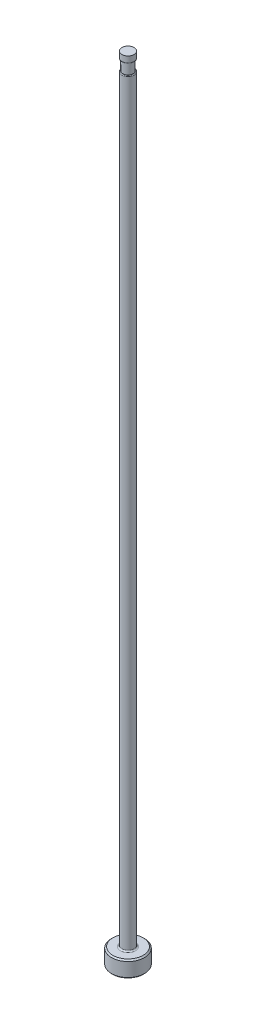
from build123d import *

# Parameters (mm, degrees)
CHAMFER1_SIZE     = 0.254
FILLET1_R         = 0.254
SKETCH2_W         = 0.2032
SKETCH2_H         = 2.032
D_SLOT_DEPTH      = 153.466131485
D_SLOT_DEPTH_BACK = 153.466131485
SKETCH5_W         = 0.0127
SKETCH5_H         = 1.27
FILLET2_R         = 0.127


with BuildPart() as part:
    # Sketch1 → Revolve1 (revolve)
    with BuildSketch(Plane.XY, mode=Mode.PRIVATE) as revolve1_sk:
        Polygon((0, 0), (-3.175, 0), (-3.175, 3.175), (-1.18999, 3.175), (-1.18999, 152.4), (0, 152.4), align=None)
    revolve(revolve1_sk.sketch.rotate(Axis((0, 259.958771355, 0), (0, -1, 0)), 270), axis=Axis((0, 259.958771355, 0), (0, -1, 0)))

    # Chamfer1
    chamfer1_edges = [part.edges().sort_by_distance(p)[0] for p in [
        (0, 3.175, -3.175),
        (0, 0, -3.175),
    ]]
    chamfer(chamfer1_edges, length=CHAMFER1_SIZE)

    # Fillet1
    fillet1_edges = [part.edges().sort_by_distance(p)[0] for p in [
        (0, 3.175, -1.18999),
    ]]
    fillet(fillet1_edges, radius=FILLET1_R)

    # Sketch2 → Vent Relief (revolve, cut)
    with BuildSketch(Plane.XY, mode=Mode.PRIVATE) as vent_relief_sk:
        with Locations((-1.08839, 150.114)):
            Rectangle(SKETCH2_W, SKETCH2_H)
    revolve(vent_relief_sk.sketch.rotate(Axis((0, 153.448281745, 0), (0, -1, 0)), 270), axis=Axis((0, 153.448281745, 0), (0, -1, 0)), mode=Mode.SUBTRACT)

    # Sketch3 → D-Slot (cut, two sides: drawn at the far end of the back side and taken through both)
    with BuildSketch(Plane.XY.offset(-D_SLOT_DEPTH_BACK)):
        with BuildLine():
            Line((-0.98679, 150.114), (-0.98679, 86.614))
            ThreePointArc((-0.98679, 86.614), (-1.038003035, 86.046038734), (-1.18999, 85.4964))
            Line((-1.18999, 85.4964), (-1.18999, 150.114))
            Line((-1.18999, 150.114), (-0.98679, 150.114))
        make_face()
    extrude(amount=D_SLOT_DEPTH + D_SLOT_DEPTH_BACK, mode=Mode.SUBTRACT)

    # Sketch5 → Vent Diameter (revolve, cut)
    with BuildSketch(Plane.XY, mode=Mode.PRIVATE) as vent_diameter_sk:
        with Locations((-1.18364, 151.765)):
            Rectangle(SKETCH5_W, SKETCH5_H)
    revolve(vent_diameter_sk.sketch.rotate(Axis((0, 152.687735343, 0), (0, -1, 0)), 90), axis=Axis((0, 152.687735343, 0), (0, -1, 0)), mode=Mode.SUBTRACT)

    # Fillet2
    fillet2_edges = [part.edges().sort_by_distance(p)[0] for p in [
        (1.050596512, 149.098, -0.55885881),
        (0, 151.13, 1.17729),
    ]]
    fillet(fillet2_edges, radius=FILLET2_R)


solid = part.part
